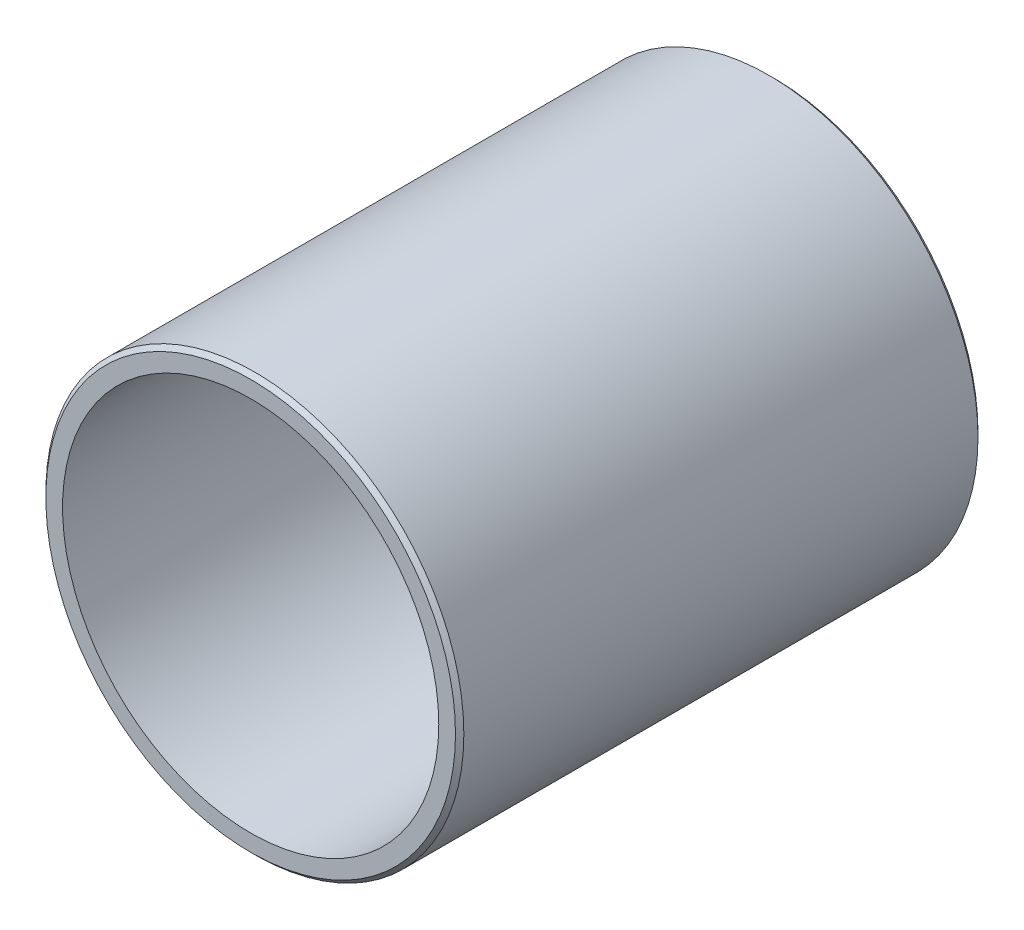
ISO-10303-21;
HEADER;
FILE_DESCRIPTION(('STEP AP214'),'2;1');
FILE_NAME('part.step','',(''),(''),'','','');
FILE_SCHEMA(('AUTOMOTIVE_DESIGN { 1 0 10303 214 1 1 1 1 }'));
ENDSEC;
DATA;
#1=APPLICATION_CONTEXT('core data for automotive mechanical design processes');
#2=APPLICATION_PROTOCOL_DEFINITION('international standard','automotive_design',2000,#1);
#3=PRODUCT_CONTEXT('',#1,'mechanical');
#4=PRODUCT('Part','Part','',(#3));
#5=PRODUCT_RELATED_PRODUCT_CATEGORY('part','',(#4));
#6=PRODUCT_DEFINITION_FORMATION('','',#4);
#7=PRODUCT_DEFINITION_CONTEXT('part definition',#1,'design');
#8=PRODUCT_DEFINITION('design','',#6,#7);
#9=PRODUCT_DEFINITION_SHAPE('','',#8);
#10=(LENGTH_UNIT() NAMED_UNIT(*) SI_UNIT(.MILLI.,.METRE.));
#11=(NAMED_UNIT(*) PLANE_ANGLE_UNIT() SI_UNIT($,.RADIAN.));
#12=(NAMED_UNIT(*) SI_UNIT($,.STERADIAN.) SOLID_ANGLE_UNIT());
#13=UNCERTAINTY_MEASURE_WITH_UNIT(LENGTH_MEASURE(1.E-05),#10,'distance_accuracy_value','');
#14=(GEOMETRIC_REPRESENTATION_CONTEXT(3) GLOBAL_UNCERTAINTY_ASSIGNED_CONTEXT((#13)) GLOBAL_UNIT_ASSIGNED_CONTEXT((#10,
#11,#12)) REPRESENTATION_CONTEXT('',''));
#15=CARTESIAN_POINT('',(0.,0.,0.));
#16=DIRECTION('',(0.,0.,1.));
#17=DIRECTION('',(1.,0.,0.));
#18=AXIS2_PLACEMENT_3D('',#15,#16,#17);
#19=CARTESIAN_POINT('',(0.,0.,-25.));
#20=DIRECTION('',(0.,0.,1.));
#21=DIRECTION('',(1.,0.,0.));
#22=AXIS2_PLACEMENT_3D('',#19,#20,#21);
#23=CYLINDRICAL_SURFACE('',#22,10.);
#24=CARTESIAN_POINT('',(0.,0.,-0.200000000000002));
#25=DIRECTION('',(0.,0.,1.));
#26=DIRECTION('',(1.,0.,0.));
#27=AXIS2_PLACEMENT_3D('',#24,#25,#26);
#28=CIRCLE('',#27,10.);
#29=CARTESIAN_POINT('',(10.,0.,-0.200000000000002));
#30=VERTEX_POINT('',#29);
#31=EDGE_CURVE('E352',#30,#30,#28,.F.);
#32=ORIENTED_EDGE('',*,*,#31,.T.);
#33=EDGE_LOOP('',(#32));
#34=FACE_BOUND('',#33,.T.);
#35=CARTESIAN_POINT('',(0.,0.,-24.8));
#36=DIRECTION('',(0.,0.,1.));
#37=DIRECTION('',(1.,0.,0.));
#38=AXIS2_PLACEMENT_3D('',#35,#36,#37);
#39=CIRCLE('',#38,10.);
#40=CARTESIAN_POINT('',(10.,0.,-24.8));
#41=VERTEX_POINT('',#40);
#42=EDGE_CURVE('E356',#41,#41,#39,.T.);
#43=ORIENTED_EDGE('',*,*,#42,.T.);
#44=EDGE_LOOP('',(#43));
#45=FACE_BOUND('',#44,.T.);
#46=ADVANCED_FACE('F346',(#34,#45),#23,.T.);
#47=CARTESIAN_POINT('',(0.,0.,-25.));
#48=DIRECTION('',(0.,0.,1.));
#49=DIRECTION('',(1.,0.,0.));
#50=AXIS2_PLACEMENT_3D('',#47,#48,#49);
#51=PLANE('',#50);
#52=CARTESIAN_POINT('',(0.,0.,-25.));
#53=DIRECTION('',(0.,0.,1.));
#54=DIRECTION('',(1.,0.,0.));
#55=AXIS2_PLACEMENT_3D('',#52,#53,#54);
#56=CIRCLE('',#55,9.8);
#57=CARTESIAN_POINT('',(9.8,0.,-25.));
#58=VERTEX_POINT('',#57);
#59=EDGE_CURVE('E10',#58,#58,#56,.F.);
#60=ORIENTED_EDGE('',*,*,#59,.T.);
#61=EDGE_LOOP('',(#60));
#62=FACE_BOUND('',#61,.T.);
#63=CARTESIAN_POINT('',(0.,0.,-25.));
#64=DIRECTION('',(0.,0.,1.));
#65=DIRECTION('',(1.,0.,0.));
#66=AXIS2_PLACEMENT_3D('',#63,#64,#65);
#67=CIRCLE('',#66,9.);
#68=CARTESIAN_POINT('',(9.,0.,-25.));
#69=VERTEX_POINT('',#68);
#70=EDGE_CURVE('E365',#69,#69,#67,.T.);
#71=ORIENTED_EDGE('',*,*,#70,.T.);
#72=EDGE_LOOP('',(#71));
#73=FACE_BOUND('',#72,.T.);
#74=ADVANCED_FACE('F376',(#62,#73),#51,.F.);
#75=CARTESIAN_POINT('',(0.,0.,0.));
#76=DIRECTION('',(0.,0.,1.));
#77=DIRECTION('',(1.,0.,0.));
#78=AXIS2_PLACEMENT_3D('',#75,#76,#77);
#79=PLANE('',#78);
#80=CARTESIAN_POINT('',(0.,0.,0.));
#81=DIRECTION('',(0.,0.,1.));
#82=DIRECTION('',(1.,0.,0.));
#83=AXIS2_PLACEMENT_3D('',#80,#81,#82);
#84=CIRCLE('',#83,9.8);
#85=CARTESIAN_POINT('',(9.8,0.,0.));
#86=VERTEX_POINT('',#85);
#87=EDGE_CURVE('E360',#86,#86,#84,.T.);
#88=ORIENTED_EDGE('',*,*,#87,.T.);
#89=EDGE_LOOP('',(#88));
#90=FACE_BOUND('',#89,.T.);
#91=CARTESIAN_POINT('',(0.,0.,0.));
#92=DIRECTION('',(0.,0.,1.));
#93=DIRECTION('',(1.,0.,0.));
#94=AXIS2_PLACEMENT_3D('',#91,#92,#93);
#95=CIRCLE('',#94,9.);
#96=CARTESIAN_POINT('',(9.,0.,0.));
#97=VERTEX_POINT('',#96);
#98=EDGE_CURVE('E368',#97,#97,#95,.T.);
#99=ORIENTED_EDGE('',*,*,#98,.F.);
#100=EDGE_LOOP('',(#99));
#101=FACE_BOUND('',#100,.T.);
#102=ADVANCED_FACE('F374',(#90,#101),#79,.T.);
#103=CARTESIAN_POINT('',(0.,0.,-25.));
#104=DIRECTION('',(0.,0.,1.));
#105=DIRECTION('',(1.,0.,0.));
#106=AXIS2_PLACEMENT_3D('',#103,#104,#105);
#107=CYLINDRICAL_SURFACE('',#106,9.);
#108=ORIENTED_EDGE('',*,*,#70,.F.);
#109=EDGE_LOOP('',(#108));
#110=FACE_BOUND('',#109,.T.);
#111=ORIENTED_EDGE('',*,*,#98,.T.);
#112=EDGE_LOOP('',(#111));
#113=FACE_BOUND('',#112,.T.);
#114=ADVANCED_FACE('F372',(#110,#113),#107,.F.);
#115=CARTESIAN_POINT('',(0.,0.,0.));
#116=DIRECTION('',(0.,0.,-1.));
#117=DIRECTION('',(-1.,0.,0.));
#118=AXIS2_PLACEMENT_3D('',#115,#116,#117);
#119=CONICAL_SURFACE('',#118,9.8,0.785398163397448);
#120=ORIENTED_EDGE('',*,*,#31,.F.);
#121=EDGE_LOOP('',(#120));
#122=FACE_BOUND('',#121,.T.);
#123=ORIENTED_EDGE('',*,*,#87,.F.);
#124=EDGE_LOOP('',(#123));
#125=FACE_BOUND('',#124,.T.);
#126=ADVANCED_FACE('F384',(#122,#125),#119,.T.);
#127=CARTESIAN_POINT('',(0.,0.,-24.8));
#128=DIRECTION('',(0.,0.,1.));
#129=DIRECTION('',(1.,0.,0.));
#130=AXIS2_PLACEMENT_3D('',#127,#128,#129);
#131=CONICAL_SURFACE('',#130,10.,0.785398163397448);
#132=ORIENTED_EDGE('',*,*,#59,.F.);
#133=EDGE_LOOP('',(#132));
#134=FACE_BOUND('',#133,.T.);
#135=ORIENTED_EDGE('',*,*,#42,.F.);
#136=EDGE_LOOP('',(#135));
#137=FACE_BOUND('',#136,.T.);
#138=ADVANCED_FACE('F393',(#134,#137),#131,.T.);
#139=CLOSED_SHELL('',(#46,#74,#102,#114,#126,#138));
#140=MANIFOLD_SOLID_BREP('B2',#139);
#141=ADVANCED_BREP_SHAPE_REPRESENTATION('',(#18,#140),#14);
#142=SHAPE_DEFINITION_REPRESENTATION(#9,#141);
ENDSEC;
END-ISO-10303-21;
